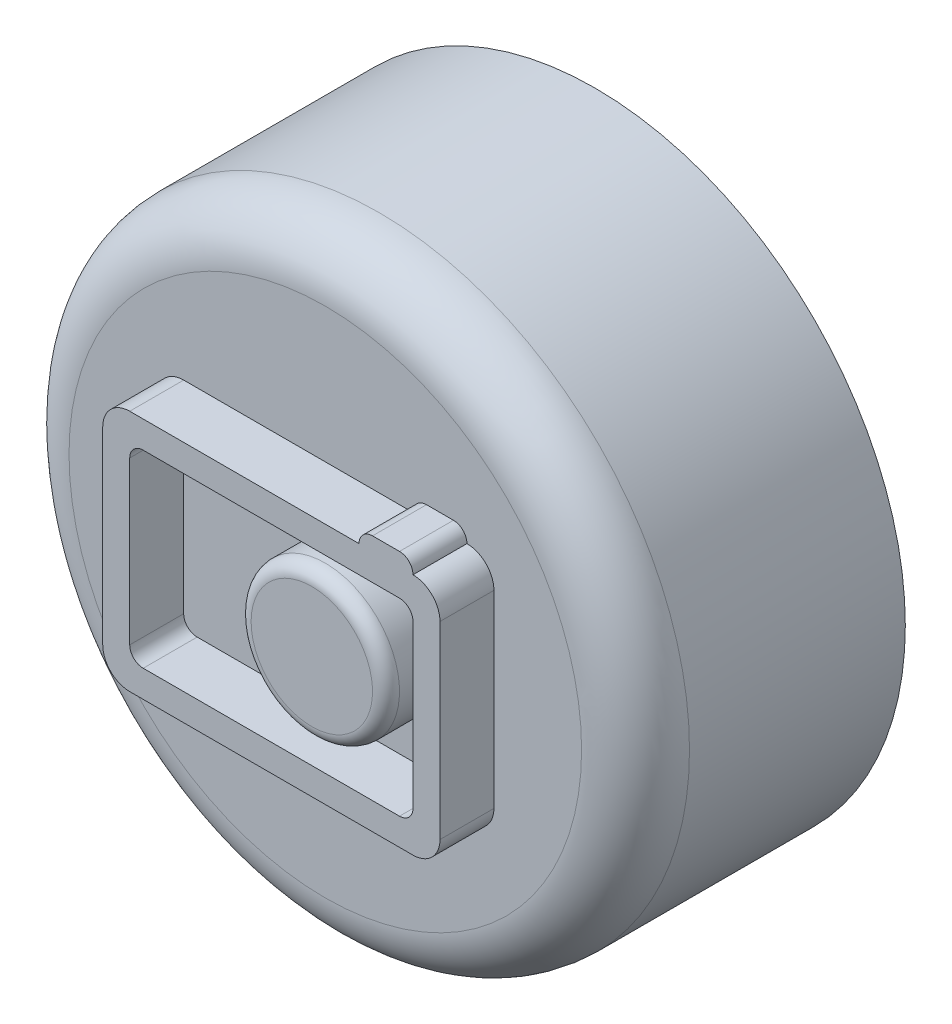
ISO-10303-21;
HEADER;
FILE_DESCRIPTION(('STEP AP214'),'2;1');
FILE_NAME('part.step','',(''),(''),'','','');
FILE_SCHEMA(('AUTOMOTIVE_DESIGN { 1 0 10303 214 1 1 1 1 }'));
ENDSEC;
DATA;
#1=APPLICATION_CONTEXT('core data for automotive mechanical design processes');
#2=APPLICATION_PROTOCOL_DEFINITION('international standard','automotive_design',2000,#1);
#3=PRODUCT_CONTEXT('',#1,'mechanical');
#4=PRODUCT('Part','Part','',(#3));
#5=PRODUCT_RELATED_PRODUCT_CATEGORY('part','',(#4));
#6=PRODUCT_DEFINITION_FORMATION('','',#4);
#7=PRODUCT_DEFINITION_CONTEXT('part definition',#1,'design');
#8=PRODUCT_DEFINITION('design','',#6,#7);
#9=PRODUCT_DEFINITION_SHAPE('','',#8);
#10=(LENGTH_UNIT() NAMED_UNIT(*) SI_UNIT(.MILLI.,.METRE.));
#11=(NAMED_UNIT(*) PLANE_ANGLE_UNIT() SI_UNIT($,.RADIAN.));
#12=(NAMED_UNIT(*) SI_UNIT($,.STERADIAN.) SOLID_ANGLE_UNIT());
#13=UNCERTAINTY_MEASURE_WITH_UNIT(LENGTH_MEASURE(1.E-05),#10,'distance_accuracy_value','');
#14=(GEOMETRIC_REPRESENTATION_CONTEXT(3) GLOBAL_UNCERTAINTY_ASSIGNED_CONTEXT((#13)) GLOBAL_UNIT_ASSIGNED_CONTEXT((#10,
#11,#12)) REPRESENTATION_CONTEXT('',''));
#15=CARTESIAN_POINT('',(0.,0.,0.));
#16=DIRECTION('',(0.,0.,1.));
#17=DIRECTION('',(1.,0.,0.));
#18=AXIS2_PLACEMENT_3D('',#15,#16,#17);
#19=CARTESIAN_POINT('',(0.,-310.,3.));
#20=DIRECTION('',(0.,0.,1.));
#21=DIRECTION('',(1.,0.,0.));
#22=AXIS2_PLACEMENT_3D('',#19,#20,#21);
#23=PLANE('',#22);
#24=CARTESIAN_POINT('',(0.,-310.,3.));
#25=DIRECTION('',(0.,0.,1.));
#26=DIRECTION('',(1.,0.,0.));
#27=AXIS2_PLACEMENT_3D('',#24,#25,#26);
#28=CIRCLE('',#27,9.50000000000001);
#29=CARTESIAN_POINT('',(9.50000000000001,-310.,3.));
#30=VERTEX_POINT('',#29);
#31=EDGE_CURVE('E315',#30,#30,#28,.T.);
#32=ORIENTED_EDGE('',*,*,#31,.T.);
#33=EDGE_LOOP('',(#32));
#34=FACE_BOUND('',#33,.T.);
#35=DIRECTION('',(-1.,0.,0.));
#36=VECTOR('',#35,1.);
#37=CARTESIAN_POINT('',(5.25,-305.,3.));
#38=LINE('',#37,#36);
#39=CARTESIAN_POINT('',(4.74999999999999,-305.,3.));
#40=VERTEX_POINT('',#39);
#41=CARTESIAN_POINT('',(3.75,-305.,3.));
#42=VERTEX_POINT('',#41);
#43=EDGE_CURVE('E262',#40,#42,#38,.T.);
#44=ORIENTED_EDGE('',*,*,#43,.F.);
#45=CARTESIAN_POINT('',(4.74999999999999,-305.5,3.));
#46=DIRECTION('',(0.,0.,1.));
#47=DIRECTION('',(1.,0.,0.));
#48=AXIS2_PLACEMENT_3D('',#45,#46,#47);
#49=CIRCLE('',#48,0.5);
#50=CARTESIAN_POINT('',(5.24999999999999,-305.5,3.));
#51=VERTEX_POINT('',#50);
#52=EDGE_CURVE('E328',#40,#51,#49,.F.);
#53=ORIENTED_EDGE('',*,*,#52,.T.);
#54=CARTESIAN_POINT('',(5.25,-306.5,3.));
#55=DIRECTION('',(0.,0.,1.));
#56=DIRECTION('',(-1.,0.,0.));
#57=AXIS2_PLACEMENT_3D('',#54,#55,#56);
#58=CIRCLE('',#57,1.);
#59=CARTESIAN_POINT('',(6.25,-306.5,3.));
#60=VERTEX_POINT('',#59);
#61=EDGE_CURVE('E186',#60,#51,#58,.T.);
#62=ORIENTED_EDGE('',*,*,#61,.F.);
#63=DIRECTION('',(0.,1.,0.));
#64=VECTOR('',#63,1.);
#65=CARTESIAN_POINT('',(6.25,-306.5,3.));
#66=LINE('',#65,#64);
#67=CARTESIAN_POINT('',(6.25,-313.5,3.));
#68=VERTEX_POINT('',#67);
#69=EDGE_CURVE('E243',#68,#60,#66,.T.);
#70=ORIENTED_EDGE('',*,*,#69,.F.);
#71=CARTESIAN_POINT('',(5.25,-313.5,3.));
#72=DIRECTION('',(0.,0.,1.));
#73=DIRECTION('',(1.,0.,0.));
#74=AXIS2_PLACEMENT_3D('',#71,#72,#73);
#75=CIRCLE('',#74,1.);
#76=CARTESIAN_POINT('',(5.24999999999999,-314.5,3.));
#77=VERTEX_POINT('',#76);
#78=EDGE_CURVE('E274',#77,#68,#75,.T.);
#79=ORIENTED_EDGE('',*,*,#78,.F.);
#80=DIRECTION('',(1.,0.,0.));
#81=VECTOR('',#80,1.);
#82=CARTESIAN_POINT('',(-5.24999999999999,-314.5,3.));
#83=LINE('',#82,#81);
#84=CARTESIAN_POINT('',(-5.24999999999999,-314.5,3.));
#85=VERTEX_POINT('',#84);
#86=EDGE_CURVE('E272',#85,#77,#83,.T.);
#87=ORIENTED_EDGE('',*,*,#86,.F.);
#88=CARTESIAN_POINT('',(-5.25,-313.5,3.));
#89=DIRECTION('',(0.,0.,1.));
#90=DIRECTION('',(1.,0.,0.));
#91=AXIS2_PLACEMENT_3D('',#88,#89,#90);
#92=CIRCLE('',#91,1.);
#93=CARTESIAN_POINT('',(-6.25,-313.5,3.));
#94=VERTEX_POINT('',#93);
#95=EDGE_CURVE('E270',#94,#85,#92,.T.);
#96=ORIENTED_EDGE('',*,*,#95,.F.);
#97=DIRECTION('',(0.,-1.,0.));
#98=VECTOR('',#97,1.);
#99=CARTESIAN_POINT('',(-6.25,-306.5,3.));
#100=LINE('',#99,#98);
#101=CARTESIAN_POINT('',(-6.25,-306.5,3.));
#102=VERTEX_POINT('',#101);
#103=EDGE_CURVE('E268',#102,#94,#100,.T.);
#104=ORIENTED_EDGE('',*,*,#103,.F.);
#105=CARTESIAN_POINT('',(-5.25,-306.5,3.));
#106=DIRECTION('',(0.,0.,1.));
#107=DIRECTION('',(1.,0.,0.));
#108=AXIS2_PLACEMENT_3D('',#105,#106,#107);
#109=CIRCLE('',#108,1.);
#110=CARTESIAN_POINT('',(-5.24999999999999,-305.5,3.));
#111=VERTEX_POINT('',#110);
#112=EDGE_CURVE('E266',#111,#102,#109,.T.);
#113=ORIENTED_EDGE('',*,*,#112,.F.);
#114=DIRECTION('',(-1.,0.,0.));
#115=VECTOR('',#114,1.);
#116=CARTESIAN_POINT('',(-5.24999999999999,-305.5,3.));
#117=LINE('',#116,#115);
#118=CARTESIAN_POINT('',(3.25,-305.5,3.));
#119=VERTEX_POINT('',#118);
#120=EDGE_CURVE('E264',#119,#111,#117,.T.);
#121=ORIENTED_EDGE('',*,*,#120,.F.);
#122=CARTESIAN_POINT('',(3.75,-305.5,3.));
#123=DIRECTION('',(0.,0.,1.));
#124=DIRECTION('',(1.,0.,0.));
#125=AXIS2_PLACEMENT_3D('',#122,#123,#124);
#126=CIRCLE('',#125,0.5);
#127=EDGE_CURVE('E330',#119,#42,#126,.F.);
#128=ORIENTED_EDGE('',*,*,#127,.T.);
#129=EDGE_LOOP('',(#44,#53,#62,#70,#79,#87,#96,#104,#113,#121,#128));
#130=FACE_BOUND('',#129,.T.);
#131=ADVANCED_FACE('F34',(#34,#130),#23,.T.);
#132=CARTESIAN_POINT('',(0.,-310.,-7.));
#133=DIRECTION('',(0.,0.,1.));
#134=DIRECTION('',(1.,0.,0.));
#135=AXIS2_PLACEMENT_3D('',#132,#133,#134);
#136=CYLINDRICAL_SURFACE('',#135,11.5);
#137=CARTESIAN_POINT('',(0.,-310.,1.));
#138=DIRECTION('',(0.,0.,1.));
#139=DIRECTION('',(1.,0.,0.));
#140=AXIS2_PLACEMENT_3D('',#137,#138,#139);
#141=CIRCLE('',#140,11.5);
#142=CARTESIAN_POINT('',(11.5,-310.,1.));
#143=VERTEX_POINT('',#142);
#144=EDGE_CURVE('E318',#143,#143,#141,.F.);
#145=ORIENTED_EDGE('',*,*,#144,.T.);
#146=EDGE_LOOP('',(#145));
#147=FACE_BOUND('',#146,.T.);
#148=CARTESIAN_POINT('',(0.,-310.,-7.));
#149=DIRECTION('',(0.,0.,1.));
#150=DIRECTION('',(1.,0.,0.));
#151=AXIS2_PLACEMENT_3D('',#148,#149,#150);
#152=CIRCLE('',#151,11.5);
#153=CARTESIAN_POINT('',(11.5,-310.,-7.));
#154=VERTEX_POINT('',#153);
#155=EDGE_CURVE('E307',#154,#154,#152,.T.);
#156=ORIENTED_EDGE('',*,*,#155,.T.);
#157=EDGE_LOOP('',(#156));
#158=FACE_BOUND('',#157,.T.);
#159=ADVANCED_FACE('F347',(#147,#158),#136,.T.);
#160=CARTESIAN_POINT('',(0.,-310.,-7.));
#161=DIRECTION('',(0.,0.,1.));
#162=DIRECTION('',(1.,0.,0.));
#163=AXIS2_PLACEMENT_3D('',#160,#161,#162);
#164=PLANE('',#163);
#165=CARTESIAN_POINT('',(0.,-310.,-7.));
#166=DIRECTION('',(0.,0.,1.));
#167=DIRECTION('',(1.,0.,0.));
#168=AXIS2_PLACEMENT_3D('',#165,#166,#167);
#169=CIRCLE('',#168,10.5);
#170=CARTESIAN_POINT('',(10.5,-310.,-7.));
#171=VERTEX_POINT('',#170);
#172=EDGE_CURVE('E303',#171,#171,#169,.T.);
#173=ORIENTED_EDGE('',*,*,#172,.T.);
#174=EDGE_LOOP('',(#173));
#175=FACE_BOUND('',#174,.T.);
#176=ORIENTED_EDGE('',*,*,#155,.F.);
#177=EDGE_LOOP('',(#176));
#178=FACE_BOUND('',#177,.T.);
#179=ADVANCED_FACE('F354',(#175,#178),#164,.F.);
#180=CARTESIAN_POINT('',(0.,-310.,1.));
#181=DIRECTION('',(0.,0.,1.));
#182=DIRECTION('',(1.,0.,0.));
#183=AXIS2_PLACEMENT_3D('',#180,#181,#182);
#184=TOROIDAL_SURFACE('',#183,9.50000000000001,2.);
#185=ORIENTED_EDGE('',*,*,#144,.F.);
#186=EDGE_LOOP('',(#185));
#187=FACE_BOUND('',#186,.T.);
#188=ORIENTED_EDGE('',*,*,#31,.F.);
#189=EDGE_LOOP('',(#188));
#190=FACE_BOUND('',#189,.T.);
#191=ADVANCED_FACE('F452',(#187,#190),#184,.T.);
#192=CARTESIAN_POINT('',(0.,-310.,-7.));
#193=DIRECTION('',(0.,0.,1.));
#194=DIRECTION('',(1.,0.,0.));
#195=AXIS2_PLACEMENT_3D('',#192,#193,#194);
#196=CYLINDRICAL_SURFACE('',#195,10.5);
#197=CARTESIAN_POINT('',(0.,-310.,1.));
#198=DIRECTION('',(0.,0.,1.));
#199=DIRECTION('',(1.,0.,0.));
#200=AXIS2_PLACEMENT_3D('',#197,#198,#199);
#201=CIRCLE('',#200,10.5);
#202=CARTESIAN_POINT('',(10.5,-310.,1.));
#203=VERTEX_POINT('',#202);
#204=EDGE_CURVE('E304',#203,#203,#201,.F.);
#205=ORIENTED_EDGE('',*,*,#204,.F.);
#206=EDGE_LOOP('',(#205));
#207=FACE_BOUND('',#206,.T.);
#208=ORIENTED_EDGE('',*,*,#172,.F.);
#209=EDGE_LOOP('',(#208));
#210=FACE_BOUND('',#209,.T.);
#211=ADVANCED_FACE('F448',(#207,#210),#196,.F.);
#212=CARTESIAN_POINT('',(0.,-310.,2.));
#213=DIRECTION('',(0.,0.,1.));
#214=DIRECTION('',(1.,0.,0.));
#215=AXIS2_PLACEMENT_3D('',#212,#213,#214);
#216=PLANE('',#215);
#217=CARTESIAN_POINT('',(0.,-310.,2.));
#218=DIRECTION('',(0.,0.,1.));
#219=DIRECTION('',(1.,0.,0.));
#220=AXIS2_PLACEMENT_3D('',#217,#218,#219);
#221=CIRCLE('',#220,9.50000000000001);
#222=CARTESIAN_POINT('',(9.50000000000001,-310.,2.));
#223=VERTEX_POINT('',#222);
#224=EDGE_CURVE('E308',#223,#223,#221,.T.);
#225=ORIENTED_EDGE('',*,*,#224,.F.);
#226=EDGE_LOOP('',(#225));
#227=FACE_BOUND('',#226,.T.);
#228=ADVANCED_FACE('F451',(#227),#216,.F.);
#229=CARTESIAN_POINT('',(0.,-310.,1.));
#230=DIRECTION('',(0.,0.,1.));
#231=DIRECTION('',(1.,0.,0.));
#232=AXIS2_PLACEMENT_3D('',#229,#230,#231);
#233=TOROIDAL_SURFACE('',#232,9.50000000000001,1.);
#234=ORIENTED_EDGE('',*,*,#204,.T.);
#235=EDGE_LOOP('',(#234));
#236=FACE_BOUND('',#235,.T.);
#237=ORIENTED_EDGE('',*,*,#224,.T.);
#238=EDGE_LOOP('',(#237));
#239=FACE_BOUND('',#238,.T.);
#240=ADVANCED_FACE('F414',(#236,#239),#233,.F.);
#241=CARTESIAN_POINT('',(5.25,-306.5,5.));
#242=DIRECTION('',(0.,0.,-1.));
#243=DIRECTION('',(-1.,0.,0.));
#244=AXIS2_PLACEMENT_3D('',#241,#242,#243);
#245=PLANE('',#244);
#246=CARTESIAN_POINT('',(5.25,-306.5,5.));
#247=DIRECTION('',(0.,0.,1.));
#248=DIRECTION('',(-1.,0.,0.));
#249=AXIS2_PLACEMENT_3D('',#246,#247,#248);
#250=CIRCLE('',#249,1.);
#251=CARTESIAN_POINT('',(6.25,-306.5,5.));
#252=VERTEX_POINT('',#251);
#253=CARTESIAN_POINT('',(5.24999999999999,-305.5,5.));
#254=VERTEX_POINT('',#253);
#255=EDGE_CURVE('E240',#252,#254,#250,.T.);
#256=ORIENTED_EDGE('',*,*,#255,.T.);
#257=CARTESIAN_POINT('',(4.74999999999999,-305.5,5.));
#258=DIRECTION('',(0.,0.,-1.));
#259=DIRECTION('',(-1.,0.,0.));
#260=AXIS2_PLACEMENT_3D('',#257,#258,#259);
#261=CIRCLE('',#260,0.5);
#262=CARTESIAN_POINT('',(4.74999999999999,-305.,5.));
#263=VERTEX_POINT('',#262);
#264=EDGE_CURVE('E56',#254,#263,#261,.F.);
#265=ORIENTED_EDGE('',*,*,#264,.T.);
#266=DIRECTION('',(-1.,0.,0.));
#267=VECTOR('',#266,1.);
#268=CARTESIAN_POINT('',(5.25,-305.,5.));
#269=LINE('',#268,#267);
#270=CARTESIAN_POINT('',(3.75,-305.,5.));
#271=VERTEX_POINT('',#270);
#272=EDGE_CURVE('E242',#263,#271,#269,.T.);
#273=ORIENTED_EDGE('',*,*,#272,.T.);
#274=CARTESIAN_POINT('',(3.75,-305.5,5.));
#275=DIRECTION('',(0.,0.,-1.));
#276=DIRECTION('',(-1.,0.,0.));
#277=AXIS2_PLACEMENT_3D('',#274,#275,#276);
#278=CIRCLE('',#277,0.5);
#279=CARTESIAN_POINT('',(3.25,-305.5,5.));
#280=VERTEX_POINT('',#279);
#281=EDGE_CURVE('E325',#271,#280,#278,.F.);
#282=ORIENTED_EDGE('',*,*,#281,.T.);
#283=DIRECTION('',(-1.,0.,0.));
#284=VECTOR('',#283,1.);
#285=CARTESIAN_POINT('',(-5.24999999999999,-305.5,5.));
#286=LINE('',#285,#284);
#287=CARTESIAN_POINT('',(-5.24999999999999,-305.5,5.));
#288=VERTEX_POINT('',#287);
#289=EDGE_CURVE('E245',#280,#288,#286,.T.);
#290=ORIENTED_EDGE('',*,*,#289,.T.);
#291=CARTESIAN_POINT('',(-5.25,-306.5,5.));
#292=DIRECTION('',(0.,0.,1.));
#293=DIRECTION('',(1.,0.,0.));
#294=AXIS2_PLACEMENT_3D('',#291,#292,#293);
#295=CIRCLE('',#294,1.);
#296=CARTESIAN_POINT('',(-6.25,-306.5,5.));
#297=VERTEX_POINT('',#296);
#298=EDGE_CURVE('E247',#288,#297,#295,.T.);
#299=ORIENTED_EDGE('',*,*,#298,.T.);
#300=DIRECTION('',(0.,-1.,0.));
#301=VECTOR('',#300,1.);
#302=CARTESIAN_POINT('',(-6.25,-306.5,5.));
#303=LINE('',#302,#301);
#304=CARTESIAN_POINT('',(-6.25,-313.5,5.));
#305=VERTEX_POINT('',#304);
#306=EDGE_CURVE('E249',#297,#305,#303,.T.);
#307=ORIENTED_EDGE('',*,*,#306,.T.);
#308=CARTESIAN_POINT('',(-5.25,-313.5,5.));
#309=DIRECTION('',(0.,0.,1.));
#310=DIRECTION('',(1.,0.,0.));
#311=AXIS2_PLACEMENT_3D('',#308,#309,#310);
#312=CIRCLE('',#311,1.);
#313=CARTESIAN_POINT('',(-5.24999999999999,-314.5,5.));
#314=VERTEX_POINT('',#313);
#315=EDGE_CURVE('E251',#305,#314,#312,.T.);
#316=ORIENTED_EDGE('',*,*,#315,.T.);
#317=DIRECTION('',(1.,0.,0.));
#318=VECTOR('',#317,1.);
#319=CARTESIAN_POINT('',(-5.24999999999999,-314.5,5.));
#320=LINE('',#319,#318);
#321=CARTESIAN_POINT('',(5.24999999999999,-314.5,5.));
#322=VERTEX_POINT('',#321);
#323=EDGE_CURVE('E253',#314,#322,#320,.T.);
#324=ORIENTED_EDGE('',*,*,#323,.T.);
#325=CARTESIAN_POINT('',(5.25,-313.5,5.));
#326=DIRECTION('',(0.,0.,1.));
#327=DIRECTION('',(1.,0.,0.));
#328=AXIS2_PLACEMENT_3D('',#325,#326,#327);
#329=CIRCLE('',#328,1.);
#330=CARTESIAN_POINT('',(6.25,-313.5,5.));
#331=VERTEX_POINT('',#330);
#332=EDGE_CURVE('E255',#322,#331,#329,.T.);
#333=ORIENTED_EDGE('',*,*,#332,.T.);
#334=DIRECTION('',(0.,1.,0.));
#335=VECTOR('',#334,1.);
#336=CARTESIAN_POINT('',(6.25,-306.5,5.));
#337=LINE('',#336,#335);
#338=EDGE_CURVE('E257',#331,#252,#337,.T.);
#339=ORIENTED_EDGE('',*,*,#338,.T.);
#340=EDGE_LOOP('',(#256,#265,#273,#282,#290,#299,#307,#316,#324,#333,#339));
#341=FACE_BOUND('',#340,.T.);
#342=CARTESIAN_POINT('',(4.75,-313.,5.));
#343=DIRECTION('',(0.,0.,1.));
#344=DIRECTION('',(-1.,0.,0.));
#345=AXIS2_PLACEMENT_3D('',#342,#343,#344);
#346=CIRCLE('',#345,0.5);
#347=CARTESIAN_POINT('',(4.75,-313.5,5.));
#348=VERTEX_POINT('',#347);
#349=CARTESIAN_POINT('',(5.25,-313.,5.));
#350=VERTEX_POINT('',#349);
#351=EDGE_CURVE('E167',#348,#350,#346,.T.);
#352=ORIENTED_EDGE('',*,*,#351,.F.);
#353=DIRECTION('',(1.,0.,0.));
#354=VECTOR('',#353,1.);
#355=CARTESIAN_POINT('',(-4.74999999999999,-313.5,5.));
#356=LINE('',#355,#354);
#357=CARTESIAN_POINT('',(-4.74999999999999,-313.5,5.));
#358=VERTEX_POINT('',#357);
#359=EDGE_CURVE('E206',#358,#348,#356,.T.);
#360=ORIENTED_EDGE('',*,*,#359,.F.);
#361=CARTESIAN_POINT('',(-4.74999999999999,-313.,5.));
#362=DIRECTION('',(0.,0.,1.));
#363=DIRECTION('',(-1.,0.,0.));
#364=AXIS2_PLACEMENT_3D('',#361,#362,#363);
#365=CIRCLE('',#364,0.5);
#366=CARTESIAN_POINT('',(-5.24999999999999,-313.,5.));
#367=VERTEX_POINT('',#366);
#368=EDGE_CURVE('E203',#367,#358,#365,.T.);
#369=ORIENTED_EDGE('',*,*,#368,.F.);
#370=DIRECTION('',(0.,-1.,0.));
#371=VECTOR('',#370,1.);
#372=CARTESIAN_POINT('',(-5.25,-307.,5.));
#373=LINE('',#372,#371);
#374=CARTESIAN_POINT('',(-5.25,-307.,5.));
#375=VERTEX_POINT('',#374);
#376=EDGE_CURVE('E201',#375,#367,#373,.T.);
#377=ORIENTED_EDGE('',*,*,#376,.F.);
#378=CARTESIAN_POINT('',(-4.75,-307.,5.));
#379=DIRECTION('',(0.,0.,1.));
#380=DIRECTION('',(-1.,0.,0.));
#381=AXIS2_PLACEMENT_3D('',#378,#379,#380);
#382=CIRCLE('',#381,0.5);
#383=CARTESIAN_POINT('',(-4.75,-306.5,5.));
#384=VERTEX_POINT('',#383);
#385=EDGE_CURVE('E199',#384,#375,#382,.T.);
#386=ORIENTED_EDGE('',*,*,#385,.F.);
#387=DIRECTION('',(-1.,0.,0.));
#388=VECTOR('',#387,1.);
#389=CARTESIAN_POINT('',(-4.75,-306.5,5.));
#390=LINE('',#389,#388);
#391=CARTESIAN_POINT('',(4.75,-306.5,5.));
#392=VERTEX_POINT('',#391);
#393=EDGE_CURVE('E194',#392,#384,#390,.T.);
#394=ORIENTED_EDGE('',*,*,#393,.F.);
#395=CARTESIAN_POINT('',(4.75,-307.,5.));
#396=DIRECTION('',(0.,0.,1.));
#397=DIRECTION('',(1.,0.,0.));
#398=AXIS2_PLACEMENT_3D('',#395,#396,#397);
#399=CIRCLE('',#398,0.5);
#400=CARTESIAN_POINT('',(5.25,-307.,5.));
#401=VERTEX_POINT('',#400);
#402=EDGE_CURVE('E192',#401,#392,#399,.T.);
#403=ORIENTED_EDGE('',*,*,#402,.F.);
#404=DIRECTION('',(0.,1.,0.));
#405=VECTOR('',#404,1.);
#406=CARTESIAN_POINT('',(5.25,-307.,5.));
#407=LINE('',#406,#405);
#408=EDGE_CURVE('E177',#350,#401,#407,.T.);
#409=ORIENTED_EDGE('',*,*,#408,.F.);
#410=EDGE_LOOP('',(#352,#360,#369,#377,#386,#394,#403,#409));
#411=FACE_BOUND('',#410,.T.);
#412=ADVANCED_FACE('F190',(#341,#411),#245,.F.);
#413=CARTESIAN_POINT('',(5.25,-306.5,5.));
#414=DIRECTION('',(0.,0.,-1.));
#415=DIRECTION('',(-1.,0.,0.));
#416=AXIS2_PLACEMENT_3D('',#413,#414,#415);
#417=CYLINDRICAL_SURFACE('',#416,1.);
#418=ORIENTED_EDGE('',*,*,#61,.T.);
#419=DIRECTION('',(0.,0.,-1.));
#420=VECTOR('',#419,1.);
#421=CARTESIAN_POINT('',(5.24999999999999,-305.5,5.));
#422=LINE('',#421,#420);
#423=EDGE_CURVE('E300',#254,#51,#422,.T.);
#424=ORIENTED_EDGE('',*,*,#423,.F.);
#425=ORIENTED_EDGE('',*,*,#255,.F.);
#426=DIRECTION('',(0.,0.,-1.));
#427=VECTOR('',#426,1.);
#428=CARTESIAN_POINT('',(6.25,-306.5,5.));
#429=LINE('',#428,#427);
#430=EDGE_CURVE('E259',#252,#60,#429,.T.);
#431=ORIENTED_EDGE('',*,*,#430,.T.);
#432=EDGE_LOOP('',(#418,#424,#425,#431));
#433=FACE_BOUND('',#432,.T.);
#434=ADVANCED_FACE('F413',(#433),#417,.T.);
#435=CARTESIAN_POINT('',(5.25,-305.,5.));
#436=DIRECTION('',(0.,-1.,0.));
#437=DIRECTION('',(0.,0.,-1.));
#438=AXIS2_PLACEMENT_3D('',#435,#436,#437);
#439=PLANE('',#438);
#440=ORIENTED_EDGE('',*,*,#272,.F.);
#441=DIRECTION('',(0.,0.,-1.));
#442=VECTOR('',#441,1.);
#443=CARTESIAN_POINT('',(4.74999999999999,-305.,5.));
#444=LINE('',#443,#442);
#445=EDGE_CURVE('E322',#263,#40,#444,.T.);
#446=ORIENTED_EDGE('',*,*,#445,.T.);
#447=ORIENTED_EDGE('',*,*,#43,.T.);
#448=DIRECTION('',(0.,0.,-1.));
#449=VECTOR('',#448,1.);
#450=CARTESIAN_POINT('',(3.75,-305.,5.));
#451=LINE('',#450,#449);
#452=EDGE_CURVE('E49',#42,#271,#451,.F.);
#453=ORIENTED_EDGE('',*,*,#452,.T.);
#454=EDGE_LOOP('',(#440,#446,#447,#453));
#455=FACE_BOUND('',#454,.T.);
#456=ADVANCED_FACE('F441',(#455),#439,.F.);
#457=CARTESIAN_POINT('',(-5.24999999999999,-305.5,5.));
#458=DIRECTION('',(0.,-1.,0.));
#459=DIRECTION('',(0.,0.,-1.));
#460=AXIS2_PLACEMENT_3D('',#457,#458,#459);
#461=PLANE('',#460);
#462=ORIENTED_EDGE('',*,*,#120,.T.);
#463=DIRECTION('',(0.,0.,-1.));
#464=VECTOR('',#463,1.);
#465=CARTESIAN_POINT('',(-5.24999999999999,-305.5,5.));
#466=LINE('',#465,#464);
#467=EDGE_CURVE('E294',#288,#111,#466,.T.);
#468=ORIENTED_EDGE('',*,*,#467,.F.);
#469=ORIENTED_EDGE('',*,*,#289,.F.);
#470=DIRECTION('',(0.,0.,-1.));
#471=VECTOR('',#470,1.);
#472=CARTESIAN_POINT('',(3.25,-305.5,5.));
#473=LINE('',#472,#471);
#474=EDGE_CURVE('E297',#280,#119,#473,.T.);
#475=ORIENTED_EDGE('',*,*,#474,.T.);
#476=EDGE_LOOP('',(#462,#468,#469,#475));
#477=FACE_BOUND('',#476,.T.);
#478=ADVANCED_FACE('F437',(#477),#461,.F.);
#479=CARTESIAN_POINT('',(-5.25,-306.5,5.));
#480=DIRECTION('',(0.,0.,-1.));
#481=DIRECTION('',(-1.,0.,0.));
#482=AXIS2_PLACEMENT_3D('',#479,#480,#481);
#483=CYLINDRICAL_SURFACE('',#482,1.);
#484=ORIENTED_EDGE('',*,*,#112,.T.);
#485=DIRECTION('',(0.,0.,-1.));
#486=VECTOR('',#485,1.);
#487=CARTESIAN_POINT('',(-6.25,-306.5,5.));
#488=LINE('',#487,#486);
#489=EDGE_CURVE('E291',#297,#102,#488,.T.);
#490=ORIENTED_EDGE('',*,*,#489,.F.);
#491=ORIENTED_EDGE('',*,*,#298,.F.);
#492=ORIENTED_EDGE('',*,*,#467,.T.);
#493=EDGE_LOOP('',(#484,#490,#491,#492));
#494=FACE_BOUND('',#493,.T.);
#495=ADVANCED_FACE('F433',(#494),#483,.T.);
#496=CARTESIAN_POINT('',(-6.25,-306.5,5.));
#497=DIRECTION('',(1.,0.,0.));
#498=DIRECTION('',(0.,1.,0.));
#499=AXIS2_PLACEMENT_3D('',#496,#497,#498);
#500=PLANE('',#499);
#501=ORIENTED_EDGE('',*,*,#103,.T.);
#502=DIRECTION('',(0.,0.,-1.));
#503=VECTOR('',#502,1.);
#504=CARTESIAN_POINT('',(-6.25,-313.5,5.));
#505=LINE('',#504,#503);
#506=EDGE_CURVE('E288',#305,#94,#505,.T.);
#507=ORIENTED_EDGE('',*,*,#506,.F.);
#508=ORIENTED_EDGE('',*,*,#306,.F.);
#509=ORIENTED_EDGE('',*,*,#489,.T.);
#510=EDGE_LOOP('',(#501,#507,#508,#509));
#511=FACE_BOUND('',#510,.T.);
#512=ADVANCED_FACE('F429',(#511),#500,.F.);
#513=CARTESIAN_POINT('',(-5.25,-313.5,5.));
#514=DIRECTION('',(0.,0.,-1.));
#515=DIRECTION('',(-1.,0.,0.));
#516=AXIS2_PLACEMENT_3D('',#513,#514,#515);
#517=CYLINDRICAL_SURFACE('',#516,1.);
#518=ORIENTED_EDGE('',*,*,#95,.T.);
#519=DIRECTION('',(0.,0.,-1.));
#520=VECTOR('',#519,1.);
#521=CARTESIAN_POINT('',(-5.24999999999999,-314.5,5.));
#522=LINE('',#521,#520);
#523=EDGE_CURVE('E285',#314,#85,#522,.T.);
#524=ORIENTED_EDGE('',*,*,#523,.F.);
#525=ORIENTED_EDGE('',*,*,#315,.F.);
#526=ORIENTED_EDGE('',*,*,#506,.T.);
#527=EDGE_LOOP('',(#518,#524,#525,#526));
#528=FACE_BOUND('',#527,.T.);
#529=ADVANCED_FACE('F425',(#528),#517,.T.);
#530=CARTESIAN_POINT('',(-5.24999999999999,-314.5,5.));
#531=DIRECTION('',(0.,1.,0.));
#532=DIRECTION('',(0.,0.,1.));
#533=AXIS2_PLACEMENT_3D('',#530,#531,#532);
#534=PLANE('',#533);
#535=ORIENTED_EDGE('',*,*,#86,.T.);
#536=DIRECTION('',(0.,0.,-1.));
#537=VECTOR('',#536,1.);
#538=CARTESIAN_POINT('',(5.24999999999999,-314.5,5.));
#539=LINE('',#538,#537);
#540=EDGE_CURVE('E282',#322,#77,#539,.T.);
#541=ORIENTED_EDGE('',*,*,#540,.F.);
#542=ORIENTED_EDGE('',*,*,#323,.F.);
#543=ORIENTED_EDGE('',*,*,#523,.T.);
#544=EDGE_LOOP('',(#535,#541,#542,#543));
#545=FACE_BOUND('',#544,.T.);
#546=ADVANCED_FACE('F421',(#545),#534,.F.);
#547=CARTESIAN_POINT('',(5.25,-313.5,5.));
#548=DIRECTION('',(0.,0.,-1.));
#549=DIRECTION('',(-1.,0.,0.));
#550=AXIS2_PLACEMENT_3D('',#547,#548,#549);
#551=CYLINDRICAL_SURFACE('',#550,1.);
#552=ORIENTED_EDGE('',*,*,#78,.T.);
#553=DIRECTION('',(0.,0.,-1.));
#554=VECTOR('',#553,1.);
#555=CARTESIAN_POINT('',(6.25,-313.5,5.));
#556=LINE('',#555,#554);
#557=EDGE_CURVE('E280',#331,#68,#556,.T.);
#558=ORIENTED_EDGE('',*,*,#557,.F.);
#559=ORIENTED_EDGE('',*,*,#332,.F.);
#560=ORIENTED_EDGE('',*,*,#540,.T.);
#561=EDGE_LOOP('',(#552,#558,#559,#560));
#562=FACE_BOUND('',#561,.T.);
#563=ADVANCED_FACE('F417',(#562),#551,.T.);
#564=CARTESIAN_POINT('',(6.25,-306.5,5.));
#565=DIRECTION('',(-1.,0.,0.));
#566=DIRECTION('',(0.,-1.,0.));
#567=AXIS2_PLACEMENT_3D('',#564,#565,#566);
#568=PLANE('',#567);
#569=ORIENTED_EDGE('',*,*,#69,.T.);
#570=ORIENTED_EDGE('',*,*,#430,.F.);
#571=ORIENTED_EDGE('',*,*,#338,.F.);
#572=ORIENTED_EDGE('',*,*,#557,.T.);
#573=EDGE_LOOP('',(#569,#570,#571,#572));
#574=FACE_BOUND('',#573,.T.);
#575=ADVANCED_FACE('F410',(#574),#568,.F.);
#576=CARTESIAN_POINT('',(4.75,-313.,5.));
#577=DIRECTION('',(0.,0.,-1.));
#578=DIRECTION('',(-1.,0.,0.));
#579=AXIS2_PLACEMENT_3D('',#576,#577,#578);
#580=CYLINDRICAL_SURFACE('',#579,0.5);
#581=CARTESIAN_POINT('',(4.75,-313.,3.));
#582=DIRECTION('',(0.,0.,1.));
#583=DIRECTION('',(-1.,0.,0.));
#584=AXIS2_PLACEMENT_3D('',#581,#582,#583);
#585=CIRCLE('',#584,0.5);
#586=CARTESIAN_POINT('',(4.75,-313.5,3.));
#587=VERTEX_POINT('',#586);
#588=CARTESIAN_POINT('',(5.25,-313.,3.));
#589=VERTEX_POINT('',#588);
#590=EDGE_CURVE('E208',#587,#589,#585,.T.);
#591=ORIENTED_EDGE('',*,*,#590,.F.);
#592=DIRECTION('',(0.,0.,-1.));
#593=VECTOR('',#592,1.);
#594=CARTESIAN_POINT('',(4.75,-313.5,5.));
#595=LINE('',#594,#593);
#596=EDGE_CURVE('E173',#348,#587,#595,.T.);
#597=ORIENTED_EDGE('',*,*,#596,.F.);
#598=ORIENTED_EDGE('',*,*,#351,.T.);
#599=DIRECTION('',(0.,0.,-1.));
#600=VECTOR('',#599,1.);
#601=CARTESIAN_POINT('',(5.25,-313.,5.));
#602=LINE('',#601,#600);
#603=EDGE_CURVE('E171',#350,#589,#602,.T.);
#604=ORIENTED_EDGE('',*,*,#603,.T.);
#605=EDGE_LOOP('',(#591,#597,#598,#604));
#606=FACE_BOUND('',#605,.T.);
#607=ADVANCED_FACE('F170',(#606),#580,.F.);
#608=CARTESIAN_POINT('',(5.25,-307.,5.));
#609=DIRECTION('',(-1.,0.,0.));
#610=DIRECTION('',(0.,0.,1.));
#611=AXIS2_PLACEMENT_3D('',#608,#609,#610);
#612=PLANE('',#611);
#613=DIRECTION('',(0.,1.,0.));
#614=VECTOR('',#613,1.);
#615=CARTESIAN_POINT('',(5.25,-307.,3.));
#616=LINE('',#615,#614);
#617=CARTESIAN_POINT('',(5.25,-307.,3.));
#618=VERTEX_POINT('',#617);
#619=EDGE_CURVE('E185',#589,#618,#616,.T.);
#620=ORIENTED_EDGE('',*,*,#619,.F.);
#621=ORIENTED_EDGE('',*,*,#603,.F.);
#622=ORIENTED_EDGE('',*,*,#408,.T.);
#623=DIRECTION('',(0.,0.,-1.));
#624=VECTOR('',#623,1.);
#625=CARTESIAN_POINT('',(5.25,-307.,5.));
#626=LINE('',#625,#624);
#627=EDGE_CURVE('E187',#401,#618,#626,.T.);
#628=ORIENTED_EDGE('',*,*,#627,.T.);
#629=EDGE_LOOP('',(#620,#621,#622,#628));
#630=FACE_BOUND('',#629,.T.);
#631=ADVANCED_FACE('F182',(#630),#612,.T.);
#632=CARTESIAN_POINT('',(4.75,-307.,5.));
#633=DIRECTION('',(0.,0.,-1.));
#634=DIRECTION('',(-1.,0.,0.));
#635=AXIS2_PLACEMENT_3D('',#632,#633,#634);
#636=CYLINDRICAL_SURFACE('',#635,0.5);
#637=CARTESIAN_POINT('',(4.75,-307.,3.));
#638=DIRECTION('',(0.,0.,1.));
#639=DIRECTION('',(1.,0.,0.));
#640=AXIS2_PLACEMENT_3D('',#637,#638,#639);
#641=CIRCLE('',#640,0.5);
#642=CARTESIAN_POINT('',(4.75,-306.5,3.));
#643=VERTEX_POINT('',#642);
#644=EDGE_CURVE('E212',#618,#643,#641,.T.);
#645=ORIENTED_EDGE('',*,*,#644,.F.);
#646=ORIENTED_EDGE('',*,*,#627,.F.);
#647=ORIENTED_EDGE('',*,*,#402,.T.);
#648=DIRECTION('',(0.,0.,-1.));
#649=VECTOR('',#648,1.);
#650=CARTESIAN_POINT('',(4.75,-306.5,5.));
#651=LINE('',#650,#649);
#652=EDGE_CURVE('E236',#392,#643,#651,.T.);
#653=ORIENTED_EDGE('',*,*,#652,.T.);
#654=EDGE_LOOP('',(#645,#646,#647,#653));
#655=FACE_BOUND('',#654,.T.);
#656=ADVANCED_FACE('F397',(#655),#636,.F.);
#657=CARTESIAN_POINT('',(-4.75,-306.5,5.));
#658=DIRECTION('',(0.,-1.,0.));
#659=DIRECTION('',(0.,0.,-1.));
#660=AXIS2_PLACEMENT_3D('',#657,#658,#659);
#661=PLANE('',#660);
#662=DIRECTION('',(-1.,0.,0.));
#663=VECTOR('',#662,1.);
#664=CARTESIAN_POINT('',(-4.75,-306.5,3.));
#665=LINE('',#664,#663);
#666=CARTESIAN_POINT('',(-4.75,-306.5,3.));
#667=VERTEX_POINT('',#666);
#668=EDGE_CURVE('E214',#643,#667,#665,.T.);
#669=ORIENTED_EDGE('',*,*,#668,.F.);
#670=ORIENTED_EDGE('',*,*,#652,.F.);
#671=ORIENTED_EDGE('',*,*,#393,.T.);
#672=DIRECTION('',(0.,0.,-1.));
#673=VECTOR('',#672,1.);
#674=CARTESIAN_POINT('',(-4.75,-306.5,5.));
#675=LINE('',#674,#673);
#676=EDGE_CURVE('E233',#384,#667,#675,.T.);
#677=ORIENTED_EDGE('',*,*,#676,.T.);
#678=EDGE_LOOP('',(#669,#670,#671,#677));
#679=FACE_BOUND('',#678,.T.);
#680=ADVANCED_FACE('F394',(#679),#661,.T.);
#681=CARTESIAN_POINT('',(-4.75,-307.,5.));
#682=DIRECTION('',(0.,0.,-1.));
#683=DIRECTION('',(-1.,0.,0.));
#684=AXIS2_PLACEMENT_3D('',#681,#682,#683);
#685=CYLINDRICAL_SURFACE('',#684,0.5);
#686=CARTESIAN_POINT('',(-4.75,-307.,3.));
#687=DIRECTION('',(0.,0.,1.));
#688=DIRECTION('',(-1.,0.,0.));
#689=AXIS2_PLACEMENT_3D('',#686,#687,#688);
#690=CIRCLE('',#689,0.5);
#691=CARTESIAN_POINT('',(-5.25,-307.,3.));
#692=VERTEX_POINT('',#691);
#693=EDGE_CURVE('E216',#667,#692,#690,.T.);
#694=ORIENTED_EDGE('',*,*,#693,.F.);
#695=ORIENTED_EDGE('',*,*,#676,.F.);
#696=ORIENTED_EDGE('',*,*,#385,.T.);
#697=DIRECTION('',(0.,0.,-1.));
#698=VECTOR('',#697,1.);
#699=CARTESIAN_POINT('',(-5.25,-307.,5.));
#700=LINE('',#699,#698);
#701=EDGE_CURVE('E230',#375,#692,#700,.T.);
#702=ORIENTED_EDGE('',*,*,#701,.T.);
#703=EDGE_LOOP('',(#694,#695,#696,#702));
#704=FACE_BOUND('',#703,.T.);
#705=ADVANCED_FACE('F389',(#704),#685,.F.);
#706=CARTESIAN_POINT('',(-5.25,-307.,5.));
#707=DIRECTION('',(1.,0.,0.));
#708=DIRECTION('',(0.,1.,0.));
#709=AXIS2_PLACEMENT_3D('',#706,#707,#708);
#710=PLANE('',#709);
#711=DIRECTION('',(0.,-1.,0.));
#712=VECTOR('',#711,1.);
#713=CARTESIAN_POINT('',(-5.25,-307.,3.));
#714=LINE('',#713,#712);
#715=CARTESIAN_POINT('',(-5.24999999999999,-313.,3.));
#716=VERTEX_POINT('',#715);
#717=EDGE_CURVE('E218',#692,#716,#714,.T.);
#718=ORIENTED_EDGE('',*,*,#717,.F.);
#719=ORIENTED_EDGE('',*,*,#701,.F.);
#720=ORIENTED_EDGE('',*,*,#376,.T.);
#721=DIRECTION('',(0.,0.,-1.));
#722=VECTOR('',#721,1.);
#723=CARTESIAN_POINT('',(-5.24999999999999,-313.,5.));
#724=LINE('',#723,#722);
#725=EDGE_CURVE('E227',#367,#716,#724,.T.);
#726=ORIENTED_EDGE('',*,*,#725,.T.);
#727=EDGE_LOOP('',(#718,#719,#720,#726));
#728=FACE_BOUND('',#727,.T.);
#729=ADVANCED_FACE('F385',(#728),#710,.T.);
#730=CARTESIAN_POINT('',(-4.74999999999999,-313.,5.));
#731=DIRECTION('',(0.,0.,-1.));
#732=DIRECTION('',(-1.,0.,0.));
#733=AXIS2_PLACEMENT_3D('',#730,#731,#732);
#734=CYLINDRICAL_SURFACE('',#733,0.5);
#735=CARTESIAN_POINT('',(-4.74999999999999,-313.,3.));
#736=DIRECTION('',(0.,0.,1.));
#737=DIRECTION('',(-1.,0.,0.));
#738=AXIS2_PLACEMENT_3D('',#735,#736,#737);
#739=CIRCLE('',#738,0.5);
#740=CARTESIAN_POINT('',(-4.74999999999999,-313.5,3.));
#741=VERTEX_POINT('',#740);
#742=EDGE_CURVE('E220',#716,#741,#739,.T.);
#743=ORIENTED_EDGE('',*,*,#742,.F.);
#744=ORIENTED_EDGE('',*,*,#725,.F.);
#745=ORIENTED_EDGE('',*,*,#368,.T.);
#746=DIRECTION('',(0.,0.,-1.));
#747=VECTOR('',#746,1.);
#748=CARTESIAN_POINT('',(-4.74999999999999,-313.5,5.));
#749=LINE('',#748,#747);
#750=EDGE_CURVE('E224',#358,#741,#749,.T.);
#751=ORIENTED_EDGE('',*,*,#750,.T.);
#752=EDGE_LOOP('',(#743,#744,#745,#751));
#753=FACE_BOUND('',#752,.T.);
#754=ADVANCED_FACE('F370',(#753),#734,.F.);
#755=CARTESIAN_POINT('',(-4.74999999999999,-313.5,5.));
#756=DIRECTION('',(0.,1.,0.));
#757=DIRECTION('',(0.,0.,1.));
#758=AXIS2_PLACEMENT_3D('',#755,#756,#757);
#759=PLANE('',#758);
#760=DIRECTION('',(1.,0.,0.));
#761=VECTOR('',#760,1.);
#762=CARTESIAN_POINT('',(-4.74999999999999,-313.5,3.));
#763=LINE('',#762,#761);
#764=EDGE_CURVE('E178',#741,#587,#763,.T.);
#765=ORIENTED_EDGE('',*,*,#764,.F.);
#766=ORIENTED_EDGE('',*,*,#750,.F.);
#767=ORIENTED_EDGE('',*,*,#359,.T.);
#768=ORIENTED_EDGE('',*,*,#596,.T.);
#769=EDGE_LOOP('',(#765,#766,#767,#768));
#770=FACE_BOUND('',#769,.T.);
#771=ADVANCED_FACE('F361',(#770),#759,.T.);
#772=CARTESIAN_POINT('',(1.49999999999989,-310.,3.));
#773=DIRECTION('',(0.,0.,1.));
#774=DIRECTION('',(1.,0.,0.));
#775=AXIS2_PLACEMENT_3D('',#772,#773,#774);
#776=CIRCLE('',#775,2.75);
#777=CARTESIAN_POINT('',(4.2499999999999,-310.,3.));
#778=VERTEX_POINT('',#777);
#779=EDGE_CURVE('E210',#778,#778,#776,.T.);
#780=ORIENTED_EDGE('',*,*,#779,.F.);
#781=EDGE_LOOP('',(#780));
#782=FACE_BOUND('',#781,.T.);
#783=ORIENTED_EDGE('',*,*,#590,.T.);
#784=ORIENTED_EDGE('',*,*,#619,.T.);
#785=ORIENTED_EDGE('',*,*,#644,.T.);
#786=ORIENTED_EDGE('',*,*,#668,.T.);
#787=ORIENTED_EDGE('',*,*,#693,.T.);
#788=ORIENTED_EDGE('',*,*,#717,.T.);
#789=ORIENTED_EDGE('',*,*,#742,.T.);
#790=ORIENTED_EDGE('',*,*,#764,.T.);
#791=EDGE_LOOP('',(#783,#784,#785,#786,#787,#788,#789,#790));
#792=FACE_BOUND('',#791,.T.);
#793=ADVANCED_FACE('F350',(#782,#792),#23,.T.);
#794=CARTESIAN_POINT('',(4.74999999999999,-305.5,5.));
#795=DIRECTION('',(0.,0.,-1.));
#796=DIRECTION('',(-1.,0.,0.));
#797=AXIS2_PLACEMENT_3D('',#794,#795,#796);
#798=CYLINDRICAL_SURFACE('',#797,0.5);
#799=ORIENTED_EDGE('',*,*,#264,.F.);
#800=ORIENTED_EDGE('',*,*,#423,.T.);
#801=ORIENTED_EDGE('',*,*,#52,.F.);
#802=ORIENTED_EDGE('',*,*,#445,.F.);
#803=EDGE_LOOP('',(#799,#800,#801,#802));
#804=FACE_BOUND('',#803,.T.);
#805=ADVANCED_FACE('F360',(#804),#798,.T.);
#806=CARTESIAN_POINT('',(3.75,-305.5,5.));
#807=DIRECTION('',(0.,0.,-1.));
#808=DIRECTION('',(-1.,0.,0.));
#809=AXIS2_PLACEMENT_3D('',#806,#807,#808);
#810=CYLINDRICAL_SURFACE('',#809,0.5);
#811=ORIENTED_EDGE('',*,*,#281,.F.);
#812=ORIENTED_EDGE('',*,*,#452,.F.);
#813=ORIENTED_EDGE('',*,*,#127,.F.);
#814=ORIENTED_EDGE('',*,*,#474,.F.);
#815=EDGE_LOOP('',(#811,#812,#813,#814));
#816=FACE_BOUND('',#815,.T.);
#817=ADVANCED_FACE('F367',(#816),#810,.T.);
#818=CARTESIAN_POINT('',(1.49999999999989,-310.,12.778174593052));
#819=DIRECTION('',(0.,0.,-1.));
#820=DIRECTION('',(-1.,0.,0.));
#821=AXIS2_PLACEMENT_3D('',#818,#819,#820);
#822=CYLINDRICAL_SURFACE('',#821,2.75);
#823=CARTESIAN_POINT('',(1.49999999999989,-310.,4.5));
#824=DIRECTION('',(0.,0.,-1.));
#825=DIRECTION('',(-1.,0.,0.));
#826=AXIS2_PLACEMENT_3D('',#823,#824,#825);
#827=CIRCLE('',#826,2.75);
#828=CARTESIAN_POINT('',(-1.25000000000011,-310.,4.5));
#829=VERTEX_POINT('',#828);
#830=EDGE_CURVE('E42',#829,#829,#827,.T.);
#831=ORIENTED_EDGE('',*,*,#830,.T.);
#832=EDGE_LOOP('',(#831));
#833=FACE_BOUND('',#832,.T.);
#834=ORIENTED_EDGE('',*,*,#779,.T.);
#835=EDGE_LOOP('',(#834));
#836=FACE_BOUND('',#835,.T.);
#837=ADVANCED_FACE('F334',(#833,#836),#822,.T.);
#838=CARTESIAN_POINT('',(5.25,-306.5,5.));
#839=DIRECTION('',(0.,0.,-1.));
#840=DIRECTION('',(-1.,0.,0.));
#841=AXIS2_PLACEMENT_3D('',#838,#839,#840);
#842=PLANE('',#841);
#843=CARTESIAN_POINT('',(1.49999999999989,-310.,5.));
#844=DIRECTION('',(0.,0.,-1.));
#845=DIRECTION('',(-1.,0.,0.));
#846=AXIS2_PLACEMENT_3D('',#843,#844,#845);
#847=CIRCLE('',#846,2.25);
#848=CARTESIAN_POINT('',(-0.750000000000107,-310.,5.));
#849=VERTEX_POINT('',#848);
#850=EDGE_CURVE('E11',#849,#849,#847,.F.);
#851=ORIENTED_EDGE('',*,*,#850,.T.);
#852=EDGE_LOOP('',(#851));
#853=FACE_BOUND('',#852,.T.);
#854=ADVANCED_FACE('F338',(#853),#842,.F.);
#855=CARTESIAN_POINT('',(1.49999999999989,-310.,4.5));
#856=DIRECTION('',(0.,0.,-1.));
#857=DIRECTION('',(-1.,0.,0.));
#858=AXIS2_PLACEMENT_3D('',#855,#856,#857);
#859=TOROIDAL_SURFACE('',#858,2.25,0.5);
#860=ORIENTED_EDGE('',*,*,#850,.F.);
#861=EDGE_LOOP('',(#860));
#862=FACE_BOUND('',#861,.T.);
#863=ORIENTED_EDGE('',*,*,#830,.F.);
#864=EDGE_LOOP('',(#863));
#865=FACE_BOUND('',#864,.T.);
#866=ADVANCED_FACE('F36',(#862,#865),#859,.T.);
#867=CLOSED_SHELL('',(#131,#159,#179,#191,#211,#228,#240,#412,#434,#456,#478,#495,#512,#529,
#546,#563,#575,#607,#631,#656,#680,#705,#729,#754,#771,#793,#805,#817,#837,#854,#866));
#868=MANIFOLD_SOLID_BREP('B2',#867);
#869=ADVANCED_BREP_SHAPE_REPRESENTATION('',(#18,#868),#14);
#870=SHAPE_DEFINITION_REPRESENTATION(#9,#869);
ENDSEC;
END-ISO-10303-21;
